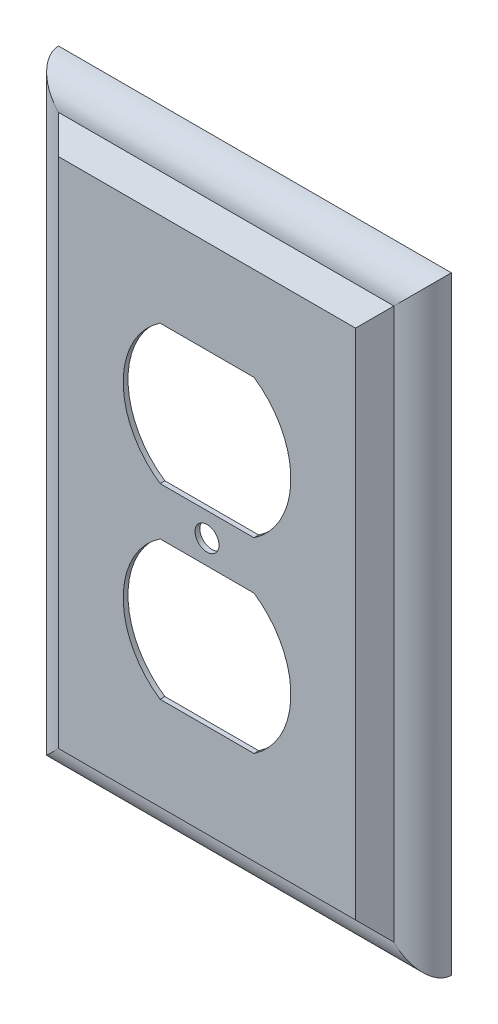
ISO-10303-21;
HEADER;
FILE_DESCRIPTION(('STEP AP214'),'2;1');
FILE_NAME('part.step','',(''),(''),'','','');
FILE_SCHEMA(('AUTOMOTIVE_DESIGN { 1 0 10303 214 1 1 1 1 }'));
ENDSEC;
DATA;
#1=APPLICATION_CONTEXT('core data for automotive mechanical design processes');
#2=APPLICATION_PROTOCOL_DEFINITION('international standard','automotive_design',2000,#1);
#3=PRODUCT_CONTEXT('',#1,'mechanical');
#4=PRODUCT('Part','Part','',(#3));
#5=PRODUCT_RELATED_PRODUCT_CATEGORY('part','',(#4));
#6=PRODUCT_DEFINITION_FORMATION('','',#4);
#7=PRODUCT_DEFINITION_CONTEXT('part definition',#1,'design');
#8=PRODUCT_DEFINITION('design','',#6,#7);
#9=PRODUCT_DEFINITION_SHAPE('','',#8);
#10=(LENGTH_UNIT() NAMED_UNIT(*) SI_UNIT(.MILLI.,.METRE.));
#11=(NAMED_UNIT(*) PLANE_ANGLE_UNIT() SI_UNIT($,.RADIAN.));
#12=(NAMED_UNIT(*) SI_UNIT($,.STERADIAN.) SOLID_ANGLE_UNIT());
#13=UNCERTAINTY_MEASURE_WITH_UNIT(LENGTH_MEASURE(1.E-05),#10,'distance_accuracy_value','');
#14=(GEOMETRIC_REPRESENTATION_CONTEXT(3) GLOBAL_UNCERTAINTY_ASSIGNED_CONTEXT((#13)) GLOBAL_UNIT_ASSIGNED_CONTEXT((#10,
#11,#12)) REPRESENTATION_CONTEXT('',''));
#15=CARTESIAN_POINT('',(0.,0.,0.));
#16=DIRECTION('',(0.,0.,1.));
#17=DIRECTION('',(1.,0.,0.));
#18=AXIS2_PLACEMENT_3D('',#15,#16,#17);
#19=CARTESIAN_POINT('',(0.,115.,0.));
#20=DIRECTION('',(0.,0.,-1.));
#21=DIRECTION('',(-1.,0.,0.));
#22=AXIS2_PLACEMENT_3D('',#19,#20,#21);
#23=PLANE('',#22);
#24=DIRECTION('',(-1.,0.,0.));
#25=VECTOR('',#24,1.);
#26=CARTESIAN_POINT('',(0.,114.,0.));
#27=LINE('',#26,#25);
#28=CARTESIAN_POINT('',(69.,114.,0.));
#29=VERTEX_POINT('',#28);
#30=CARTESIAN_POINT('',(1.,114.,0.));
#31=VERTEX_POINT('',#30);
#32=EDGE_CURVE('E264',#29,#31,#27,.T.);
#33=ORIENTED_EDGE('',*,*,#32,.T.);
#34=DIRECTION('',(0.,-1.,0.));
#35=VECTOR('',#34,1.);
#36=CARTESIAN_POINT('',(1.,115.,0.));
#37=LINE('',#36,#35);
#38=CARTESIAN_POINT('',(1.,1.,0.));
#39=VERTEX_POINT('',#38);
#40=EDGE_CURVE('E278',#31,#39,#37,.T.);
#41=ORIENTED_EDGE('',*,*,#40,.T.);
#42=DIRECTION('',(1.,0.,0.));
#43=VECTOR('',#42,1.);
#44=CARTESIAN_POINT('',(0.,1.,0.));
#45=LINE('',#44,#43);
#46=CARTESIAN_POINT('',(69.,1.,0.));
#47=VERTEX_POINT('',#46);
#48=EDGE_CURVE('E294',#39,#47,#45,.T.);
#49=ORIENTED_EDGE('',*,*,#48,.T.);
#50=DIRECTION('',(0.,1.,0.));
#51=VECTOR('',#50,1.);
#52=CARTESIAN_POINT('',(69.,115.,0.));
#53=LINE('',#52,#51);
#54=EDGE_CURVE('E297',#47,#29,#53,.T.);
#55=ORIENTED_EDGE('',*,*,#54,.T.);
#56=EDGE_LOOP('',(#33,#41,#49,#55));
#57=FACE_BOUND('',#56,.T.);
#58=DIRECTION('',(0.,1.,0.));
#59=VECTOR('',#58,1.);
#60=CARTESIAN_POINT('',(76.,-22.9705627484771,0.));
#61=LINE('',#60,#59);
#62=CARTESIAN_POINT('',(76.,-5.99999999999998,0.));
#63=VERTEX_POINT('',#62);
#64=CARTESIAN_POINT('',(76.,121.,0.));
#65=VERTEX_POINT('',#64);
#66=EDGE_CURVE('E191',#63,#65,#61,.T.);
#67=ORIENTED_EDGE('',*,*,#66,.F.);
#68=DIRECTION('',(-1.,0.,0.));
#69=VECTOR('',#68,1.);
#70=CARTESIAN_POINT('',(76.,-5.99999999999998,0.));
#71=LINE('',#70,#69);
#72=CARTESIAN_POINT('',(-5.99999999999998,-5.99999999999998,0.));
#73=VERTEX_POINT('',#72);
#74=EDGE_CURVE('E175',#63,#73,#71,.T.);
#75=ORIENTED_EDGE('',*,*,#74,.T.);
#76=DIRECTION('',(0.,1.,0.));
#77=VECTOR('',#76,1.);
#78=CARTESIAN_POINT('',(-5.99999999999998,-5.99999999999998,0.));
#79=LINE('',#78,#77);
#80=CARTESIAN_POINT('',(-5.99999999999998,121.,0.));
#81=VERTEX_POINT('',#80);
#82=EDGE_CURVE('E363',#73,#81,#79,.T.);
#83=ORIENTED_EDGE('',*,*,#82,.T.);
#84=DIRECTION('',(1.,0.,0.));
#85=VECTOR('',#84,1.);
#86=CARTESIAN_POINT('',(-5.99999999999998,121.,0.));
#87=LINE('',#86,#85);
#88=EDGE_CURVE('E194',#81,#65,#87,.T.);
#89=ORIENTED_EDGE('',*,*,#88,.T.);
#90=EDGE_LOOP('',(#67,#75,#83,#89));
#91=FACE_BOUND('',#90,.T.);
#92=ADVANCED_FACE('F35',(#57,#91),#23,.T.);
#93=CARTESIAN_POINT('',(0.,115.,10.));
#94=DIRECTION('',(0.,0.,-1.));
#95=DIRECTION('',(-1.,0.,0.));
#96=AXIS2_PLACEMENT_3D('',#93,#94,#95);
#97=PLANE('',#96);
#98=CARTESIAN_POINT('',(35.,57.5,10.));
#99=DIRECTION('',(0.,0.,1.));
#100=DIRECTION('',(1.,0.,0.));
#101=AXIS2_PLACEMENT_3D('',#98,#99,#100);
#102=CIRCLE('',#101,2.5);
#103=CARTESIAN_POINT('',(37.5,57.5,10.));
#104=VERTEX_POINT('',#103);
#105=EDGE_CURVE('E205',#104,#104,#102,.T.);
#106=ORIENTED_EDGE('',*,*,#105,.F.);
#107=EDGE_LOOP('',(#106));
#108=FACE_BOUND('',#107,.T.);
#109=DIRECTION('',(-1.,0.,0.));
#110=VECTOR('',#109,1.);
#111=CARTESIAN_POINT('',(25.2020410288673,62.5,10.));
#112=LINE('',#111,#110);
#113=CARTESIAN_POINT('',(44.7979589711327,62.5,10.));
#114=VERTEX_POINT('',#113);
#115=CARTESIAN_POINT('',(25.2020410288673,62.5,10.));
#116=VERTEX_POINT('',#115);
#117=EDGE_CURVE('E217',#114,#116,#112,.T.);
#118=ORIENTED_EDGE('',*,*,#117,.T.);
#119=CARTESIAN_POINT('',(35.,77.,10.));
#120=DIRECTION('',(0.,0.,-1.));
#121=DIRECTION('',(-1.,0.,0.));
#122=AXIS2_PLACEMENT_3D('',#119,#120,#121);
#123=CIRCLE('',#122,17.5);
#124=CARTESIAN_POINT('',(25.2020410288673,91.5,10.));
#125=VERTEX_POINT('',#124);
#126=EDGE_CURVE('E210',#116,#125,#123,.T.);
#127=ORIENTED_EDGE('',*,*,#126,.T.);
#128=DIRECTION('',(1.,0.,0.));
#129=VECTOR('',#128,1.);
#130=CARTESIAN_POINT('',(25.2020410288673,91.5,10.));
#131=LINE('',#130,#129);
#132=CARTESIAN_POINT('',(44.7979589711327,91.5,10.));
#133=VERTEX_POINT('',#132);
#134=EDGE_CURVE('E213',#125,#133,#131,.T.);
#135=ORIENTED_EDGE('',*,*,#134,.T.);
#136=CARTESIAN_POINT('',(35.,77.,10.));
#137=DIRECTION('',(0.,0.,-1.));
#138=DIRECTION('',(-1.,0.,0.));
#139=AXIS2_PLACEMENT_3D('',#136,#137,#138);
#140=CIRCLE('',#139,17.5);
#141=EDGE_CURVE('E52',#133,#114,#140,.T.);
#142=ORIENTED_EDGE('',*,*,#141,.T.);
#143=EDGE_LOOP('',(#118,#127,#135,#142));
#144=FACE_BOUND('',#143,.T.);
#145=DIRECTION('',(-1.,0.,0.));
#146=VECTOR('',#145,1.);
#147=CARTESIAN_POINT('',(25.2020410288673,23.5,10.));
#148=LINE('',#147,#146);
#149=CARTESIAN_POINT('',(44.7979589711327,23.5,10.));
#150=VERTEX_POINT('',#149);
#151=CARTESIAN_POINT('',(25.2020410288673,23.5,10.));
#152=VERTEX_POINT('',#151);
#153=EDGE_CURVE('E238',#150,#152,#148,.T.);
#154=ORIENTED_EDGE('',*,*,#153,.T.);
#155=CARTESIAN_POINT('',(35.,38.,10.));
#156=DIRECTION('',(0.,0.,-1.));
#157=DIRECTION('',(-1.,0.,0.));
#158=AXIS2_PLACEMENT_3D('',#155,#156,#157);
#159=CIRCLE('',#158,17.5);
#160=CARTESIAN_POINT('',(25.2020410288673,52.5,10.));
#161=VERTEX_POINT('',#160);
#162=EDGE_CURVE('E223',#152,#161,#159,.T.);
#163=ORIENTED_EDGE('',*,*,#162,.T.);
#164=DIRECTION('',(1.,0.,0.));
#165=VECTOR('',#164,1.);
#166=CARTESIAN_POINT('',(25.2020410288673,52.5,10.));
#167=LINE('',#166,#165);
#168=CARTESIAN_POINT('',(44.7979589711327,52.5,10.));
#169=VERTEX_POINT('',#168);
#170=EDGE_CURVE('E232',#161,#169,#167,.T.);
#171=ORIENTED_EDGE('',*,*,#170,.T.);
#172=CARTESIAN_POINT('',(35.,38.,10.));
#173=DIRECTION('',(0.,0.,-1.));
#174=DIRECTION('',(-1.,0.,0.));
#175=AXIS2_PLACEMENT_3D('',#172,#173,#174);
#176=CIRCLE('',#175,17.5);
#177=EDGE_CURVE('E235',#169,#150,#176,.T.);
#178=ORIENTED_EDGE('',*,*,#177,.T.);
#179=EDGE_LOOP('',(#154,#163,#171,#178));
#180=FACE_BOUND('',#179,.T.);
#181=DIRECTION('',(0.,1.,0.));
#182=VECTOR('',#181,1.);
#183=CARTESIAN_POINT('',(65.9999999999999,115.,10.));
#184=LINE('',#183,#182);
#185=CARTESIAN_POINT('',(65.9999999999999,4.00000000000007,10.));
#186=VERTEX_POINT('',#185);
#187=CARTESIAN_POINT('',(65.9999999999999,111.,10.));
#188=VERTEX_POINT('',#187);
#189=EDGE_CURVE('E307',#186,#188,#184,.T.);
#190=ORIENTED_EDGE('',*,*,#189,.T.);
#191=DIRECTION('',(-1.,0.,0.));
#192=VECTOR('',#191,1.);
#193=CARTESIAN_POINT('',(0.,111.,10.));
#194=LINE('',#193,#192);
#195=CARTESIAN_POINT('',(4.00000000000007,111.,10.));
#196=VERTEX_POINT('',#195);
#197=EDGE_CURVE('E309',#188,#196,#194,.T.);
#198=ORIENTED_EDGE('',*,*,#197,.T.);
#199=DIRECTION('',(0.,-1.,0.));
#200=VECTOR('',#199,1.);
#201=CARTESIAN_POINT('',(4.00000000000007,115.,10.));
#202=LINE('',#201,#200);
#203=CARTESIAN_POINT('',(4.00000000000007,4.00000000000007,10.));
#204=VERTEX_POINT('',#203);
#205=EDGE_CURVE('E302',#196,#204,#202,.T.);
#206=ORIENTED_EDGE('',*,*,#205,.T.);
#207=DIRECTION('',(1.,0.,0.));
#208=VECTOR('',#207,1.);
#209=CARTESIAN_POINT('',(0.,4.00000000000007,10.));
#210=LINE('',#209,#208);
#211=EDGE_CURVE('E304',#204,#186,#210,.T.);
#212=ORIENTED_EDGE('',*,*,#211,.T.);
#213=EDGE_LOOP('',(#190,#198,#206,#212));
#214=FACE_BOUND('',#213,.T.);
#215=ADVANCED_FACE('F372',(#108,#144,#180,#214),#97,.F.);
#216=CARTESIAN_POINT('',(0.,4.00000000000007,10.));
#217=DIRECTION('',(0.,0.707106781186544,-0.707106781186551));
#218=DIRECTION('',(0.,0.707106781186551,0.707106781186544));
#219=AXIS2_PLACEMENT_3D('',#216,#217,#218);
#220=PLANE('',#219);
#221=DIRECTION('',(0.577350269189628,0.577350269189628,0.577350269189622));
#222=VECTOR('',#221,1.);
#223=CARTESIAN_POINT('',(41.0000000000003,41.0000000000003,46.9999999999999));
#224=LINE('',#223,#222);
#225=CARTESIAN_POINT('',(0.,0.,5.99999999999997));
#226=VERTEX_POINT('',#225);
#227=EDGE_CURVE('E321',#226,#204,#224,.T.);
#228=ORIENTED_EDGE('',*,*,#227,.F.);
#229=DIRECTION('',(-1.,0.,0.));
#230=VECTOR('',#229,1.);
#231=CARTESIAN_POINT('',(0.,0.,5.99999999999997));
#232=LINE('',#231,#230);
#233=CARTESIAN_POINT('',(70.,0.,5.99999999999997));
#234=VERTEX_POINT('',#233);
#235=EDGE_CURVE('E313',#234,#226,#232,.T.);
#236=ORIENTED_EDGE('',*,*,#235,.F.);
#237=DIRECTION('',(-0.577350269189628,0.577350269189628,0.577350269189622));
#238=VECTOR('',#237,1.);
#239=CARTESIAN_POINT('',(43.9999999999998,26.0000000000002,31.9999999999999));
#240=LINE('',#239,#238);
#241=EDGE_CURVE('E305',#186,#234,#240,.F.);
#242=ORIENTED_EDGE('',*,*,#241,.F.);
#243=ORIENTED_EDGE('',*,*,#211,.F.);
#244=EDGE_LOOP('',(#228,#236,#242,#243));
#245=FACE_BOUND('',#244,.T.);
#246=ADVANCED_FACE('F37',(#245),#220,.F.);
#247=CARTESIAN_POINT('',(65.9999999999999,115.,10.));
#248=DIRECTION('',(-0.707106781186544,0.,-0.707106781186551));
#249=DIRECTION('',(-0.707106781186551,0.,0.707106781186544));
#250=AXIS2_PLACEMENT_3D('',#247,#248,#249);
#251=PLANE('',#250);
#252=ORIENTED_EDGE('',*,*,#241,.T.);
#253=DIRECTION('',(0.,-1.,0.));
#254=VECTOR('',#253,1.);
#255=CARTESIAN_POINT('',(70.,0.,5.99999999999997));
#256=LINE('',#255,#254);
#257=CARTESIAN_POINT('',(70.,115.,5.99999999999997));
#258=VERTEX_POINT('',#257);
#259=EDGE_CURVE('E192',#258,#234,#256,.T.);
#260=ORIENTED_EDGE('',*,*,#259,.F.);
#261=DIRECTION('',(-0.577350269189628,-0.577350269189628,0.577350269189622));
#262=VECTOR('',#261,1.);
#263=CARTESIAN_POINT('',(67.3333333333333,112.333333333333,8.66666666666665));
#264=LINE('',#263,#262);
#265=EDGE_CURVE('E320',#188,#258,#264,.F.);
#266=ORIENTED_EDGE('',*,*,#265,.F.);
#267=ORIENTED_EDGE('',*,*,#189,.F.);
#268=EDGE_LOOP('',(#252,#260,#266,#267));
#269=FACE_BOUND('',#268,.T.);
#270=ADVANCED_FACE('F374',(#269),#251,.F.);
#271=CARTESIAN_POINT('',(4.00000000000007,115.,10.));
#272=DIRECTION('',(0.707106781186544,0.,-0.707106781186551));
#273=DIRECTION('',(-0.707106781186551,0.,-0.707106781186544));
#274=AXIS2_PLACEMENT_3D('',#271,#272,#273);
#275=PLANE('',#274);
#276=ORIENTED_EDGE('',*,*,#227,.T.);
#277=ORIENTED_EDGE('',*,*,#205,.F.);
#278=DIRECTION('',(-0.577350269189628,0.577350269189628,-0.577350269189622));
#279=VECTOR('',#278,1.);
#280=CARTESIAN_POINT('',(2.6666666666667,112.333333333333,8.66666666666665));
#281=LINE('',#280,#279);
#282=CARTESIAN_POINT('',(0.,115.,5.99999999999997));
#283=VERTEX_POINT('',#282);
#284=EDGE_CURVE('E259',#283,#196,#281,.F.);
#285=ORIENTED_EDGE('',*,*,#284,.F.);
#286=DIRECTION('',(0.,1.,0.));
#287=VECTOR('',#286,1.);
#288=CARTESIAN_POINT('',(0.,0.,5.99999999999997));
#289=LINE('',#288,#287);
#290=EDGE_CURVE('E315',#226,#283,#289,.T.);
#291=ORIENTED_EDGE('',*,*,#290,.F.);
#292=EDGE_LOOP('',(#276,#277,#285,#291));
#293=FACE_BOUND('',#292,.T.);
#294=ADVANCED_FACE('F368',(#293),#275,.F.);
#295=CARTESIAN_POINT('',(0.,111.,10.));
#296=DIRECTION('',(0.,-0.707106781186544,-0.707106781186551));
#297=DIRECTION('',(0.,0.707106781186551,-0.707106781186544));
#298=AXIS2_PLACEMENT_3D('',#295,#296,#297);
#299=PLANE('',#298);
#300=ORIENTED_EDGE('',*,*,#265,.T.);
#301=DIRECTION('',(1.,0.,0.));
#302=VECTOR('',#301,1.);
#303=CARTESIAN_POINT('',(0.,115.,5.99999999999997));
#304=LINE('',#303,#302);
#305=EDGE_CURVE('E312',#283,#258,#304,.T.);
#306=ORIENTED_EDGE('',*,*,#305,.F.);
#307=ORIENTED_EDGE('',*,*,#284,.T.);
#308=ORIENTED_EDGE('',*,*,#197,.F.);
#309=EDGE_LOOP('',(#300,#306,#307,#308));
#310=FACE_BOUND('',#309,.T.);
#311=ADVANCED_FACE('F351',(#310),#299,.F.);
#312=CARTESIAN_POINT('',(1.,0.,10.));
#313=DIRECTION('',(1.,0.,0.));
#314=DIRECTION('',(0.,0.,-1.));
#315=AXIS2_PLACEMENT_3D('',#312,#313,#314);
#316=PLANE('',#315);
#317=DIRECTION('',(0.,0.,-1.));
#318=VECTOR('',#317,1.);
#319=CARTESIAN_POINT('',(1.,1.,10.));
#320=LINE('',#319,#318);
#321=CARTESIAN_POINT('',(0.999999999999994,1.,5.58578643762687));
#322=VERTEX_POINT('',#321);
#323=EDGE_CURVE('E253',#322,#39,#320,.T.);
#324=ORIENTED_EDGE('',*,*,#323,.T.);
#325=ORIENTED_EDGE('',*,*,#40,.F.);
#326=DIRECTION('',(0.,0.,-1.));
#327=VECTOR('',#326,1.);
#328=CARTESIAN_POINT('',(1.,114.,10.));
#329=LINE('',#328,#327);
#330=CARTESIAN_POINT('',(1.,114.,5.58578643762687));
#331=VERTEX_POINT('',#330);
#332=EDGE_CURVE('E261',#331,#31,#329,.T.);
#333=ORIENTED_EDGE('',*,*,#332,.F.);
#334=DIRECTION('',(0.,-1.,0.));
#335=VECTOR('',#334,1.);
#336=CARTESIAN_POINT('',(1.,115.,5.58578643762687));
#337=LINE('',#336,#335);
#338=EDGE_CURVE('E257',#322,#331,#337,.F.);
#339=ORIENTED_EDGE('',*,*,#338,.F.);
#340=EDGE_LOOP('',(#324,#325,#333,#339));
#341=FACE_BOUND('',#340,.T.);
#342=ADVANCED_FACE('F392',(#341),#316,.T.);
#343=CARTESIAN_POINT('',(0.,1.,10.));
#344=DIRECTION('',(0.,1.,0.));
#345=DIRECTION('',(0.,0.,1.));
#346=AXIS2_PLACEMENT_3D('',#343,#344,#345);
#347=PLANE('',#346);
#348=DIRECTION('',(0.,0.,-1.));
#349=VECTOR('',#348,1.);
#350=CARTESIAN_POINT('',(69.,1.,10.));
#351=LINE('',#350,#349);
#352=CARTESIAN_POINT('',(69.,0.999999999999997,5.58578643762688));
#353=VERTEX_POINT('',#352);
#354=EDGE_CURVE('E256',#353,#47,#351,.T.);
#355=ORIENTED_EDGE('',*,*,#354,.T.);
#356=ORIENTED_EDGE('',*,*,#48,.F.);
#357=ORIENTED_EDGE('',*,*,#323,.F.);
#358=DIRECTION('',(1.,0.,0.));
#359=VECTOR('',#358,1.);
#360=CARTESIAN_POINT('',(0.,1.,5.58578643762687));
#361=LINE('',#360,#359);
#362=EDGE_CURVE('E260',#353,#322,#361,.F.);
#363=ORIENTED_EDGE('',*,*,#362,.F.);
#364=EDGE_LOOP('',(#355,#356,#357,#363));
#365=FACE_BOUND('',#364,.T.);
#366=ADVANCED_FACE('F409',(#365),#347,.T.);
#367=CARTESIAN_POINT('',(69.,0.,10.));
#368=DIRECTION('',(-1.,0.,0.));
#369=DIRECTION('',(0.,0.,1.));
#370=AXIS2_PLACEMENT_3D('',#367,#368,#369);
#371=PLANE('',#370);
#372=DIRECTION('',(0.,0.,-1.));
#373=VECTOR('',#372,1.);
#374=CARTESIAN_POINT('',(69.,114.,10.));
#375=LINE('',#374,#373);
#376=CARTESIAN_POINT('',(69.,114.,5.58578643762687));
#377=VERTEX_POINT('',#376);
#378=EDGE_CURVE('E263',#377,#29,#375,.T.);
#379=ORIENTED_EDGE('',*,*,#378,.T.);
#380=ORIENTED_EDGE('',*,*,#54,.F.);
#381=ORIENTED_EDGE('',*,*,#354,.F.);
#382=DIRECTION('',(0.,1.,0.));
#383=VECTOR('',#382,1.);
#384=CARTESIAN_POINT('',(69.,115.,5.58578643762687));
#385=LINE('',#384,#383);
#386=EDGE_CURVE('E268',#377,#353,#385,.F.);
#387=ORIENTED_EDGE('',*,*,#386,.F.);
#388=EDGE_LOOP('',(#379,#380,#381,#387));
#389=FACE_BOUND('',#388,.T.);
#390=ADVANCED_FACE('F417',(#389),#371,.T.);
#391=CARTESIAN_POINT('',(0.,114.,10.));
#392=DIRECTION('',(0.,-1.,0.));
#393=DIRECTION('',(0.,0.,-1.));
#394=AXIS2_PLACEMENT_3D('',#391,#392,#393);
#395=PLANE('',#394);
#396=ORIENTED_EDGE('',*,*,#332,.T.);
#397=ORIENTED_EDGE('',*,*,#32,.F.);
#398=ORIENTED_EDGE('',*,*,#378,.F.);
#399=DIRECTION('',(-1.,0.,0.));
#400=VECTOR('',#399,1.);
#401=CARTESIAN_POINT('',(0.,114.,5.58578643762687));
#402=LINE('',#401,#400);
#403=EDGE_CURVE('E271',#331,#377,#402,.F.);
#404=ORIENTED_EDGE('',*,*,#403,.F.);
#405=EDGE_LOOP('',(#396,#397,#398,#404));
#406=FACE_BOUND('',#405,.T.);
#407=ADVANCED_FACE('F425',(#406),#395,.T.);
#408=CARTESIAN_POINT('',(0.,115.,9.));
#409=DIRECTION('',(0.,0.,-1.));
#410=DIRECTION('',(-1.,0.,0.));
#411=AXIS2_PLACEMENT_3D('',#408,#409,#410);
#412=PLANE('',#411);
#413=CARTESIAN_POINT('',(35.,57.5,9.));
#414=DIRECTION('',(0.,0.,-1.));
#415=DIRECTION('',(-1.,0.,0.));
#416=AXIS2_PLACEMENT_3D('',#413,#414,#415);
#417=CIRCLE('',#416,2.5);
#418=CARTESIAN_POINT('',(32.5,57.5,9.));
#419=VERTEX_POINT('',#418);
#420=EDGE_CURVE('E208',#419,#419,#417,.T.);
#421=ORIENTED_EDGE('',*,*,#420,.F.);
#422=EDGE_LOOP('',(#421));
#423=FACE_BOUND('',#422,.T.);
#424=CARTESIAN_POINT('',(35.,77.,9.));
#425=DIRECTION('',(0.,0.,-1.));
#426=DIRECTION('',(-1.,0.,0.));
#427=AXIS2_PLACEMENT_3D('',#424,#425,#426);
#428=CIRCLE('',#427,17.5);
#429=CARTESIAN_POINT('',(25.2020410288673,62.5,9.));
#430=VERTEX_POINT('',#429);
#431=CARTESIAN_POINT('',(25.2020410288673,91.5,9.));
#432=VERTEX_POINT('',#431);
#433=EDGE_CURVE('E12',#430,#432,#428,.T.);
#434=ORIENTED_EDGE('',*,*,#433,.F.);
#435=DIRECTION('',(-1.,0.,0.));
#436=VECTOR('',#435,1.);
#437=CARTESIAN_POINT('',(0.,62.5,9.));
#438=LINE('',#437,#436);
#439=CARTESIAN_POINT('',(44.7979589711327,62.5,9.));
#440=VERTEX_POINT('',#439);
#441=EDGE_CURVE('E44',#440,#430,#438,.T.);
#442=ORIENTED_EDGE('',*,*,#441,.F.);
#443=CARTESIAN_POINT('',(35.,77.,9.));
#444=DIRECTION('',(0.,0.,-1.));
#445=DIRECTION('',(-1.,0.,0.));
#446=AXIS2_PLACEMENT_3D('',#443,#444,#445);
#447=CIRCLE('',#446,17.5);
#448=CARTESIAN_POINT('',(44.7979589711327,91.5,9.));
#449=VERTEX_POINT('',#448);
#450=EDGE_CURVE('E336',#449,#440,#447,.T.);
#451=ORIENTED_EDGE('',*,*,#450,.F.);
#452=DIRECTION('',(1.,0.,0.));
#453=VECTOR('',#452,1.);
#454=CARTESIAN_POINT('',(0.,91.5,9.));
#455=LINE('',#454,#453);
#456=EDGE_CURVE('E334',#432,#449,#455,.T.);
#457=ORIENTED_EDGE('',*,*,#456,.F.);
#458=EDGE_LOOP('',(#434,#442,#451,#457));
#459=FACE_BOUND('',#458,.T.);
#460=CARTESIAN_POINT('',(35.,38.,9.));
#461=DIRECTION('',(0.,0.,-1.));
#462=DIRECTION('',(-1.,0.,0.));
#463=AXIS2_PLACEMENT_3D('',#460,#461,#462);
#464=CIRCLE('',#463,17.5);
#465=CARTESIAN_POINT('',(25.2020410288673,23.5,9.));
#466=VERTEX_POINT('',#465);
#467=CARTESIAN_POINT('',(25.2020410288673,52.5,9.));
#468=VERTEX_POINT('',#467);
#469=EDGE_CURVE('E331',#466,#468,#464,.T.);
#470=ORIENTED_EDGE('',*,*,#469,.F.);
#471=DIRECTION('',(-1.,0.,0.));
#472=VECTOR('',#471,1.);
#473=CARTESIAN_POINT('',(0.,23.5,9.));
#474=LINE('',#473,#472);
#475=CARTESIAN_POINT('',(44.7979589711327,23.5,9.));
#476=VERTEX_POINT('',#475);
#477=EDGE_CURVE('E329',#476,#466,#474,.T.);
#478=ORIENTED_EDGE('',*,*,#477,.F.);
#479=CARTESIAN_POINT('',(35.,38.,9.));
#480=DIRECTION('',(0.,0.,-1.));
#481=DIRECTION('',(-1.,0.,0.));
#482=AXIS2_PLACEMENT_3D('',#479,#480,#481);
#483=CIRCLE('',#482,17.5);
#484=CARTESIAN_POINT('',(44.7979589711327,52.5,9.));
#485=VERTEX_POINT('',#484);
#486=EDGE_CURVE('E327',#485,#476,#483,.T.);
#487=ORIENTED_EDGE('',*,*,#486,.F.);
#488=DIRECTION('',(1.,0.,0.));
#489=VECTOR('',#488,1.);
#490=CARTESIAN_POINT('',(0.,52.5,9.));
#491=LINE('',#490,#489);
#492=EDGE_CURVE('E318',#468,#485,#491,.T.);
#493=ORIENTED_EDGE('',*,*,#492,.F.);
#494=EDGE_LOOP('',(#470,#478,#487,#493));
#495=FACE_BOUND('',#494,.T.);
#496=DIRECTION('',(0.,-1.,0.));
#497=VECTOR('',#496,1.);
#498=CARTESIAN_POINT('',(65.5857864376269,115.,9.));
#499=LINE('',#498,#497);
#500=CARTESIAN_POINT('',(65.5857864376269,4.41421356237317,9.));
#501=VERTEX_POINT('',#500);
#502=CARTESIAN_POINT('',(65.5857864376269,110.585786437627,9.));
#503=VERTEX_POINT('',#502);
#504=EDGE_CURVE('E282',#501,#503,#499,.F.);
#505=ORIENTED_EDGE('',*,*,#504,.F.);
#506=DIRECTION('',(-1.,0.,0.));
#507=VECTOR('',#506,1.);
#508=CARTESIAN_POINT('',(0.,4.41421356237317,9.));
#509=LINE('',#508,#507);
#510=CARTESIAN_POINT('',(4.41421356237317,4.41421356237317,9.));
#511=VERTEX_POINT('',#510);
#512=EDGE_CURVE('E284',#511,#501,#509,.F.);
#513=ORIENTED_EDGE('',*,*,#512,.F.);
#514=DIRECTION('',(0.,1.,0.));
#515=VECTOR('',#514,1.);
#516=CARTESIAN_POINT('',(4.41421356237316,115.,9.));
#517=LINE('',#516,#515);
#518=CARTESIAN_POINT('',(4.41421356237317,110.585786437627,9.));
#519=VERTEX_POINT('',#518);
#520=EDGE_CURVE('E255',#519,#511,#517,.F.);
#521=ORIENTED_EDGE('',*,*,#520,.F.);
#522=DIRECTION('',(1.,0.,0.));
#523=VECTOR('',#522,1.);
#524=CARTESIAN_POINT('',(0.,110.585786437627,9.));
#525=LINE('',#524,#523);
#526=EDGE_CURVE('E274',#503,#519,#525,.F.);
#527=ORIENTED_EDGE('',*,*,#526,.F.);
#528=EDGE_LOOP('',(#505,#513,#521,#527));
#529=FACE_BOUND('',#528,.T.);
#530=ADVANCED_FACE('F433',(#423,#459,#495,#529),#412,.T.);
#531=CARTESIAN_POINT('',(0.,4.70710678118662,9.29289321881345));
#532=DIRECTION('',(0.,0.707106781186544,-0.707106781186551));
#533=DIRECTION('',(0.,0.707106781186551,0.707106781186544));
#534=AXIS2_PLACEMENT_3D('',#531,#532,#533);
#535=PLANE('',#534);
#536=DIRECTION('',(0.577350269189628,0.577350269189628,0.577350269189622));
#537=VECTOR('',#536,1.);
#538=CARTESIAN_POINT('',(41.4714045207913,41.4714045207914,46.0571909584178));
#539=LINE('',#538,#537);
#540=EDGE_CURVE('E279',#322,#511,#539,.T.);
#541=ORIENTED_EDGE('',*,*,#540,.T.);
#542=ORIENTED_EDGE('',*,*,#512,.T.);
#543=DIRECTION('',(0.577350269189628,-0.577350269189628,-0.577350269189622));
#544=VECTOR('',#543,1.);
#545=CARTESIAN_POINT('',(28.5285954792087,41.4714045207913,46.0571909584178));
#546=LINE('',#545,#544);
#547=EDGE_CURVE('E275',#501,#353,#546,.T.);
#548=ORIENTED_EDGE('',*,*,#547,.T.);
#549=ORIENTED_EDGE('',*,*,#362,.T.);
#550=EDGE_LOOP('',(#541,#542,#548,#549));
#551=FACE_BOUND('',#550,.T.);
#552=ADVANCED_FACE('F442',(#551),#535,.T.);
#553=CARTESIAN_POINT('',(65.2928932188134,115.,9.29289321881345));
#554=DIRECTION('',(-0.707106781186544,0.,-0.707106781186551));
#555=DIRECTION('',(-0.707106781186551,0.,0.707106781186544));
#556=AXIS2_PLACEMENT_3D('',#553,#554,#555);
#557=PLANE('',#556);
#558=ORIENTED_EDGE('',*,*,#547,.F.);
#559=ORIENTED_EDGE('',*,*,#504,.T.);
#560=DIRECTION('',(0.577350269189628,0.577350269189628,-0.577350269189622));
#561=VECTOR('',#560,1.);
#562=CARTESIAN_POINT('',(43.5285954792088,88.5285954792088,31.0571909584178));
#563=LINE('',#562,#561);
#564=EDGE_CURVE('E280',#503,#377,#563,.T.);
#565=ORIENTED_EDGE('',*,*,#564,.T.);
#566=ORIENTED_EDGE('',*,*,#386,.T.);
#567=EDGE_LOOP('',(#558,#559,#565,#566));
#568=FACE_BOUND('',#567,.T.);
#569=ADVANCED_FACE('F451',(#568),#557,.T.);
#570=CARTESIAN_POINT('',(4.70710678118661,115.,9.29289321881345));
#571=DIRECTION('',(0.707106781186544,0.,-0.707106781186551));
#572=DIRECTION('',(-0.707106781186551,0.,-0.707106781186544));
#573=AXIS2_PLACEMENT_3D('',#570,#571,#572);
#574=PLANE('',#573);
#575=ORIENTED_EDGE('',*,*,#540,.F.);
#576=ORIENTED_EDGE('',*,*,#338,.T.);
#577=DIRECTION('',(0.577350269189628,-0.577350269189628,0.577350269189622));
#578=VECTOR('',#577,1.);
#579=CARTESIAN_POINT('',(3.13807118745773,111.861928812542,7.72385762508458));
#580=LINE('',#579,#578);
#581=EDGE_CURVE('E245',#331,#519,#580,.T.);
#582=ORIENTED_EDGE('',*,*,#581,.T.);
#583=ORIENTED_EDGE('',*,*,#520,.T.);
#584=EDGE_LOOP('',(#575,#576,#582,#583));
#585=FACE_BOUND('',#584,.T.);
#586=ADVANCED_FACE('F459',(#585),#574,.T.);
#587=CARTESIAN_POINT('',(0.,110.292893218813,9.29289321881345));
#588=DIRECTION('',(0.,-0.707106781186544,-0.707106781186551));
#589=DIRECTION('',(0.,0.707106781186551,-0.707106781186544));
#590=AXIS2_PLACEMENT_3D('',#587,#588,#589);
#591=PLANE('',#590);
#592=ORIENTED_EDGE('',*,*,#564,.F.);
#593=ORIENTED_EDGE('',*,*,#526,.T.);
#594=ORIENTED_EDGE('',*,*,#581,.F.);
#595=ORIENTED_EDGE('',*,*,#403,.T.);
#596=EDGE_LOOP('',(#592,#593,#594,#595));
#597=FACE_BOUND('',#596,.T.);
#598=ADVANCED_FACE('F467',(#597),#591,.T.);
#599=CARTESIAN_POINT('',(35.,38.,10.));
#600=DIRECTION('',(0.,0.,-1.));
#601=DIRECTION('',(-1.,0.,0.));
#602=AXIS2_PLACEMENT_3D('',#599,#600,#601);
#603=CYLINDRICAL_SURFACE('',#602,17.5);
#604=ORIENTED_EDGE('',*,*,#469,.T.);
#605=DIRECTION('',(0.,0.,-1.));
#606=VECTOR('',#605,1.);
#607=CARTESIAN_POINT('',(25.2020410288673,52.5,10.));
#608=LINE('',#607,#606);
#609=EDGE_CURVE('E241',#161,#468,#608,.T.);
#610=ORIENTED_EDGE('',*,*,#609,.F.);
#611=ORIENTED_EDGE('',*,*,#162,.F.);
#612=DIRECTION('',(0.,0.,-1.));
#613=VECTOR('',#612,1.);
#614=CARTESIAN_POINT('',(25.2020410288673,23.5,10.));
#615=LINE('',#614,#613);
#616=EDGE_CURVE('E242',#152,#466,#615,.T.);
#617=ORIENTED_EDGE('',*,*,#616,.T.);
#618=EDGE_LOOP('',(#604,#610,#611,#617));
#619=FACE_BOUND('',#618,.T.);
#620=ADVANCED_FACE('F475',(#619),#603,.F.);
#621=CARTESIAN_POINT('',(25.2020410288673,23.5,10.));
#622=DIRECTION('',(0.,-1.,0.));
#623=DIRECTION('',(0.,0.,-1.));
#624=AXIS2_PLACEMENT_3D('',#621,#622,#623);
#625=PLANE('',#624);
#626=ORIENTED_EDGE('',*,*,#477,.T.);
#627=ORIENTED_EDGE('',*,*,#616,.F.);
#628=ORIENTED_EDGE('',*,*,#153,.F.);
#629=DIRECTION('',(0.,0.,-1.));
#630=VECTOR('',#629,1.);
#631=CARTESIAN_POINT('',(44.7979589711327,23.5,10.));
#632=LINE('',#631,#630);
#633=EDGE_CURVE('E246',#150,#476,#632,.T.);
#634=ORIENTED_EDGE('',*,*,#633,.T.);
#635=EDGE_LOOP('',(#626,#627,#628,#634));
#636=FACE_BOUND('',#635,.T.);
#637=ADVANCED_FACE('F482',(#636),#625,.F.);
#638=CARTESIAN_POINT('',(35.,38.,10.));
#639=DIRECTION('',(0.,0.,-1.));
#640=DIRECTION('',(-1.,0.,0.));
#641=AXIS2_PLACEMENT_3D('',#638,#639,#640);
#642=CYLINDRICAL_SURFACE('',#641,17.5);
#643=ORIENTED_EDGE('',*,*,#486,.T.);
#644=ORIENTED_EDGE('',*,*,#633,.F.);
#645=ORIENTED_EDGE('',*,*,#177,.F.);
#646=DIRECTION('',(0.,0.,-1.));
#647=VECTOR('',#646,1.);
#648=CARTESIAN_POINT('',(44.7979589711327,52.5,10.));
#649=LINE('',#648,#647);
#650=EDGE_CURVE('E249',#169,#485,#649,.T.);
#651=ORIENTED_EDGE('',*,*,#650,.T.);
#652=EDGE_LOOP('',(#643,#644,#645,#651));
#653=FACE_BOUND('',#652,.T.);
#654=ADVANCED_FACE('F490',(#653),#642,.F.);
#655=CARTESIAN_POINT('',(25.2020410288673,52.5,10.));
#656=DIRECTION('',(0.,1.,0.));
#657=DIRECTION('',(0.,0.,1.));
#658=AXIS2_PLACEMENT_3D('',#655,#656,#657);
#659=PLANE('',#658);
#660=ORIENTED_EDGE('',*,*,#492,.T.);
#661=ORIENTED_EDGE('',*,*,#650,.F.);
#662=ORIENTED_EDGE('',*,*,#170,.F.);
#663=ORIENTED_EDGE('',*,*,#609,.T.);
#664=EDGE_LOOP('',(#660,#661,#662,#663));
#665=FACE_BOUND('',#664,.T.);
#666=ADVANCED_FACE('F498',(#665),#659,.F.);
#667=CARTESIAN_POINT('',(35.,77.,10.));
#668=DIRECTION('',(0.,0.,-1.));
#669=DIRECTION('',(-1.,0.,0.));
#670=AXIS2_PLACEMENT_3D('',#667,#668,#669);
#671=CYLINDRICAL_SURFACE('',#670,17.5);
#672=ORIENTED_EDGE('',*,*,#433,.T.);
#673=DIRECTION('',(0.,0.,-1.));
#674=VECTOR('',#673,1.);
#675=CARTESIAN_POINT('',(25.2020410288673,91.5,10.));
#676=LINE('',#675,#674);
#677=EDGE_CURVE('E60',#125,#432,#676,.T.);
#678=ORIENTED_EDGE('',*,*,#677,.F.);
#679=ORIENTED_EDGE('',*,*,#126,.F.);
#680=DIRECTION('',(0.,0.,-1.));
#681=VECTOR('',#680,1.);
#682=CARTESIAN_POINT('',(25.2020410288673,62.5,10.));
#683=LINE('',#682,#681);
#684=EDGE_CURVE('E220',#116,#430,#683,.T.);
#685=ORIENTED_EDGE('',*,*,#684,.T.);
#686=EDGE_LOOP('',(#672,#678,#679,#685));
#687=FACE_BOUND('',#686,.T.);
#688=ADVANCED_FACE('F506',(#687),#671,.F.);
#689=CARTESIAN_POINT('',(25.2020410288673,62.5,10.));
#690=DIRECTION('',(0.,-1.,0.));
#691=DIRECTION('',(0.,0.,-1.));
#692=AXIS2_PLACEMENT_3D('',#689,#690,#691);
#693=PLANE('',#692);
#694=ORIENTED_EDGE('',*,*,#441,.T.);
#695=ORIENTED_EDGE('',*,*,#684,.F.);
#696=ORIENTED_EDGE('',*,*,#117,.F.);
#697=DIRECTION('',(0.,0.,-1.));
#698=VECTOR('',#697,1.);
#699=CARTESIAN_POINT('',(44.7979589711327,62.5,10.));
#700=LINE('',#699,#698);
#701=EDGE_CURVE('E224',#114,#440,#700,.T.);
#702=ORIENTED_EDGE('',*,*,#701,.T.);
#703=EDGE_LOOP('',(#694,#695,#696,#702));
#704=FACE_BOUND('',#703,.T.);
#705=ADVANCED_FACE('F514',(#704),#693,.F.);
#706=CARTESIAN_POINT('',(35.,77.,10.));
#707=DIRECTION('',(0.,0.,-1.));
#708=DIRECTION('',(-1.,0.,0.));
#709=AXIS2_PLACEMENT_3D('',#706,#707,#708);
#710=CYLINDRICAL_SURFACE('',#709,17.5);
#711=ORIENTED_EDGE('',*,*,#450,.T.);
#712=ORIENTED_EDGE('',*,*,#701,.F.);
#713=ORIENTED_EDGE('',*,*,#141,.F.);
#714=DIRECTION('',(0.,0.,-1.));
#715=VECTOR('',#714,1.);
#716=CARTESIAN_POINT('',(44.7979589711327,91.5,10.));
#717=LINE('',#716,#715);
#718=EDGE_CURVE('E227',#133,#449,#717,.T.);
#719=ORIENTED_EDGE('',*,*,#718,.T.);
#720=EDGE_LOOP('',(#711,#712,#713,#719));
#721=FACE_BOUND('',#720,.T.);
#722=ADVANCED_FACE('F522',(#721),#710,.F.);
#723=CARTESIAN_POINT('',(25.2020410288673,91.5,10.));
#724=DIRECTION('',(0.,1.,0.));
#725=DIRECTION('',(0.,0.,1.));
#726=AXIS2_PLACEMENT_3D('',#723,#724,#725);
#727=PLANE('',#726);
#728=ORIENTED_EDGE('',*,*,#456,.T.);
#729=ORIENTED_EDGE('',*,*,#718,.F.);
#730=ORIENTED_EDGE('',*,*,#134,.F.);
#731=ORIENTED_EDGE('',*,*,#677,.T.);
#732=EDGE_LOOP('',(#728,#729,#730,#731));
#733=FACE_BOUND('',#732,.T.);
#734=ADVANCED_FACE('F530',(#733),#727,.F.);
#735=CARTESIAN_POINT('',(35.,57.5,0.));
#736=DIRECTION('',(0.,0.,1.));
#737=DIRECTION('',(1.,0.,0.));
#738=AXIS2_PLACEMENT_3D('',#735,#736,#737);
#739=CYLINDRICAL_SURFACE('',#738,2.5);
#740=ORIENTED_EDGE('',*,*,#420,.T.);
#741=EDGE_LOOP('',(#740));
#742=FACE_BOUND('',#741,.T.);
#743=ORIENTED_EDGE('',*,*,#105,.T.);
#744=EDGE_LOOP('',(#743));
#745=FACE_BOUND('',#744,.T.);
#746=ADVANCED_FACE('F537',(#742,#745),#739,.F.);
#747=CARTESIAN_POINT('',(0.,115.,0.));
#748=DIRECTION('',(1.,0.,0.));
#749=DIRECTION('',(0.,0.,-1.));
#750=AXIS2_PLACEMENT_3D('',#747,#748,#749);
#751=CYLINDRICAL_SURFACE('',#750,5.99999999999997);
#752=ORIENTED_EDGE('',*,*,#305,.T.);
#753=CARTESIAN_POINT('',(70.,115.,5.99999999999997));
#754=CARTESIAN_POINT('',(70.0517006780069,115.051707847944,5.99999983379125));
#755=CARTESIAN_POINT('',(70.1034049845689,115.103412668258,5.99933159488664));
#756=CARTESIAN_POINT('',(70.1938723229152,115.193877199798,5.99699224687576));
#757=CARTESIAN_POINT('',(70.2326387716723,115.232641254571,5.9956136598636));
#758=CARTESIAN_POINT('',(70.2790663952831,115.279066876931,5.99351154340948));
#759=CARTESIAN_POINT('',(70.286736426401,115.286736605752,5.99314951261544));
#760=CARTESIAN_POINT('',(70.329494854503,115.329494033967,5.99104897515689));
#761=CARTESIAN_POINT('',(70.3645750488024,115.364575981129,5.98901659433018));
#762=CARTESIAN_POINT('',(70.4426290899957,115.44263161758,5.98380591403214));
#763=CARTESIAN_POINT('',(70.4855980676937,115.485599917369,5.98047252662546));
#764=CARTESIAN_POINT('',(70.548403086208,115.548403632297,5.97491847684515));
#765=CARTESIAN_POINT('',(70.5682555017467,115.56825559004,5.97306314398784));
#766=CARTESIAN_POINT('',(70.6109238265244,115.610923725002,5.96886069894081));
#767=CARTESIAN_POINT('',(70.6337381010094,115.633738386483,5.9664815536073));
#768=CARTESIAN_POINT('',(70.7002064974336,115.700207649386,5.95916426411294));
#769=CARTESIAN_POINT('',(70.7438417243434,115.743843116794,5.95387537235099));
#770=CARTESIAN_POINT('',(70.818441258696,115.81844193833,5.94399952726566));
#771=CARTESIAN_POINT('',(70.8494213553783,115.849421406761,5.93965175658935));
#772=CARTESIAN_POINT('',(70.8916206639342,115.891620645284,5.93339208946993));
#773=CARTESIAN_POINT('',(70.902856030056,115.902856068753,5.93169285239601));
#774=CARTESIAN_POINT('',(70.957847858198,115.957848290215,5.9232159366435));
#775=CARTESIAN_POINT('',(71.0015694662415,116.001570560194,5.91598037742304));
#776=CARTESIAN_POINT('',(71.0870541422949,116.087054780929,5.90085709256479));
#777=CARTESIAN_POINT('',(71.1288208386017,116.128820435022,5.89301060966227));
#778=CARTESIAN_POINT('',(71.2154542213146,116.215454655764,5.8757779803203));
#779=CARTESIAN_POINT('',(71.2603136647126,116.260316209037,5.86631997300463));
#780=CARTESIAN_POINT('',(71.3485724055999,116.348579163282,5.84665005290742));
#781=CARTESIAN_POINT('',(71.391975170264,116.391984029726,5.83646923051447));
#782=CARTESIAN_POINT('',(71.4773206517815,116.477330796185,5.81544195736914));
#783=CARTESIAN_POINT('',(71.5192670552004,116.519276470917,5.80462578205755));
#784=CARTESIAN_POINT('',(71.6016997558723,116.601705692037,5.78241319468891));
#785=CARTESIAN_POINT('',(71.6421899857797,116.642193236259,5.77104625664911));
#786=CARTESIAN_POINT('',(71.7023282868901,116.702328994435,5.75347701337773));
#787=CARTESIAN_POINT('',(71.7220263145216,116.722026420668,5.74761237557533));
#788=CARTESIAN_POINT('',(71.7634135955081,116.763413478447,5.73505774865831));
#789=CARTESIAN_POINT('',(71.785099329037,116.785099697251,5.72834489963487));
#790=CARTESIAN_POINT('',(71.8493522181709,116.849354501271,5.70805418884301));
#791=CARTESIAN_POINT('',(71.8918611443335,116.891865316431,5.69410697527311));
#792=CARTESIAN_POINT('',(71.975722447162,116.975729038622,5.66554596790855));
#793=CARTESIAN_POINT('',(72.0170787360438,117.017085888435,5.65095520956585));
#794=CARTESIAN_POINT('',(72.0986349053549,117.098641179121,5.6211693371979));
#795=CARTESIAN_POINT('',(72.1388388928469,117.138843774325,5.60599685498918));
#796=CARTESIAN_POINT('',(72.2180900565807,117.218091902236,5.57510830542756));
#797=CARTESIAN_POINT('',(72.2571415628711,117.257141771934,5.55941447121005));
#798=CARTESIAN_POINT('',(72.3374034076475,117.337403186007,5.52616909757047));
#799=CARTESIAN_POINT('',(72.378602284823,117.378603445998,5.5085625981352));
#800=CARTESIAN_POINT('',(72.4599853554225,117.45998898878,5.47269525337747));
#801=CARTESIAN_POINT('',(72.500173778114,117.50017850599,5.45445361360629));
#802=CARTESIAN_POINT('',(72.5795356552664,117.579541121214,5.41736542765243));
#803=CARTESIAN_POINT('',(72.618713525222,117.618718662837,5.39853783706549));
#804=CARTESIAN_POINT('',(72.696054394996,117.696057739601,5.36032606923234));
#805=CARTESIAN_POINT('',(72.73422200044,117.734223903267,5.34096060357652));
#806=CARTESIAN_POINT('',(72.7910027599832,117.791003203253,5.31137903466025));
#807=CARTESIAN_POINT('',(72.809706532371,117.809706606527,5.30150894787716));
#808=CARTESIAN_POINT('',(72.8480599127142,117.848059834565,5.28100872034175));
#809=CARTESIAN_POINT('',(72.8677062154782,117.867706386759,5.27036627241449));
#810=CARTESIAN_POINT('',(72.9260403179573,117.926041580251,5.23834248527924));
#811=CARTESIAN_POINT('',(72.9646295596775,117.964632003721,5.21660133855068));
#812=CARTESIAN_POINT('',(73.0408622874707,118.040866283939,5.17252715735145));
#813=CARTESIAN_POINT('',(73.0785105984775,118.078514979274,5.15021082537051));
#814=CARTESIAN_POINT('',(73.1528615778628,118.152865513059,5.10502675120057));
#815=CARTESIAN_POINT('',(73.1895692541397,118.189572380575,5.08217553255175));
#816=CARTESIAN_POINT('',(73.2620386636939,118.262039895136,5.0359616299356));
#817=CARTESIAN_POINT('',(73.2978056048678,118.297805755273,5.0126152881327));
#818=CARTESIAN_POINT('',(73.3702075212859,118.370207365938,4.96423807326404));
#819=CARTESIAN_POINT('',(73.4068323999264,118.406833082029,4.93917705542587));
#820=CARTESIAN_POINT('',(73.4791686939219,118.479170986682,4.88848535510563));
#821=CARTESIAN_POINT('',(73.5148854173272,118.514888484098,4.86286982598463));
#822=CARTESIAN_POINT('',(73.5854051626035,118.58540881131,4.81110447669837));
#823=CARTESIAN_POINT('',(73.620213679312,118.620217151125,4.78496964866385));
#824=CARTESIAN_POINT('',(73.6889171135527,118.688919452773,4.73220023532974));
#825=CARTESIAN_POINT('',(73.7228177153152,118.722819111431,4.70558048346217));
#826=CARTESIAN_POINT('',(73.773188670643,118.773189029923,4.66513672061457));
#827=CARTESIAN_POINT('',(73.7897970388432,118.78979711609,4.65165528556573));
#828=CARTESIAN_POINT('',(73.8234638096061,118.823463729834,4.62402580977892));
#829=CARTESIAN_POINT('',(73.8405191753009,118.840519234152,4.60987038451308));
#830=CARTESIAN_POINT('',(73.891161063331,118.891161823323,4.56736119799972));
#831=CARTESIAN_POINT('',(73.9246023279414,118.924603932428,4.53866053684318));
#832=CARTESIAN_POINT('',(73.9905822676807,118.990585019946,4.48075098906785));
#833=CARTESIAN_POINT('',(74.0231269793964,119.023130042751,4.45155585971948));
#834=CARTESIAN_POINT('',(74.0873139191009,119.087316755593,4.39268820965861));
#835=CARTESIAN_POINT('',(74.1189623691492,119.118964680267,4.36302927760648));
#836=CARTESIAN_POINT('',(74.1813565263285,119.181357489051,4.30326475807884));
#837=CARTESIAN_POINT('',(74.2121086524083,119.212108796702,4.27317258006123));
#838=CARTESIAN_POINT('',(74.2737320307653,119.273731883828,4.21154948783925));
#839=CARTESIAN_POINT('',(74.3045951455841,119.304595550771,4.18000231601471));
#840=CARTESIAN_POINT('',(74.3654184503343,119.365420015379,4.11643248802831));
#841=CARTESIAN_POINT('',(74.3953852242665,119.395387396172,4.08442243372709));
#842=CARTESIAN_POINT('',(74.4544156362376,119.454418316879,4.01995534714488));
#843=CARTESIAN_POINT('',(74.4834860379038,119.483488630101,3.9875107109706));
#844=CARTESIAN_POINT('',(74.5407238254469,119.540725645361,3.92220212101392));
#845=CARTESIAN_POINT('',(74.5688981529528,119.568899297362,3.88935035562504));
#846=CARTESIAN_POINT('',(74.6106282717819,119.610628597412,3.83960490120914));
#847=CARTESIAN_POINT('',(74.6243776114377,119.624377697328,3.82303495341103));
#848=CARTESIAN_POINT('',(74.6520239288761,119.652023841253,3.78934802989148));
#849=CARTESIAN_POINT('',(74.6659182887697,119.665918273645,3.77222676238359));
#850=CARTESIAN_POINT('',(74.7071273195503,119.707127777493,3.72086852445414));
#851=CARTESIAN_POINT('',(74.7342423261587,119.734243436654,3.686310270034));
#852=CARTESIAN_POINT('',(74.7875620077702,119.787564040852,3.61678377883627));
#853=CARTESIAN_POINT('',(74.8137739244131,119.813776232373,3.58182664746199));
#854=CARTESIAN_POINT('',(74.865287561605,119.865289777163,3.5115280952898));
#855=CARTESIAN_POINT('',(74.8905966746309,119.890598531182,3.47619752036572));
#856=CARTESIAN_POINT('',(74.9403045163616,119.940305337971,3.40517802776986));
#857=CARTESIAN_POINT('',(74.9647107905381,119.964710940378,3.36949967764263));
#858=CARTESIAN_POINT('',(75.013147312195,120.01314716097,3.29700974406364));
#859=CARTESIAN_POINT('',(75.0371720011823,120.037172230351,3.26019073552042));
#860=CARTESIAN_POINT('',(75.0843011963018,120.084302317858,3.18618446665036));
#861=CARTESIAN_POINT('',(75.107413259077,120.107414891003,3.14900683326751));
#862=CARTESIAN_POINT('',(75.152717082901,120.152719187,3.07430811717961));
#863=CARTESIAN_POINT('',(75.1749165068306,120.174918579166,3.03679633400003));
#864=CARTESIAN_POINT('',(75.2183952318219,120.218396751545,2.96145313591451));
#865=CARTESIAN_POINT('',(75.2396822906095,120.23968329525,2.923630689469));
#866=CARTESIAN_POINT('',(75.2710135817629,120.271013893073,2.86650983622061));
#867=CARTESIAN_POINT('',(75.2813129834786,120.281313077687,2.84749042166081));
#868=CARTESIAN_POINT('',(75.3018622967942,120.301862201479,2.80904571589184));
#869=CARTESIAN_POINT('',(75.3121102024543,120.312110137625,2.78961828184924));
#870=CARTESIAN_POINT('',(75.3424249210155,120.34242518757,2.73137308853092));
#871=CARTESIAN_POINT('',(75.3622320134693,120.362232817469,2.69228402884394));
#872=CARTESIAN_POINT('',(75.4009150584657,120.400916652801,2.61380810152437));
#873=CARTESIAN_POINT('',(75.4197986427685,120.419800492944,2.57442875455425));
#874=CARTESIAN_POINT('',(75.4566349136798,120.456636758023,2.49539500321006));
#875=CARTESIAN_POINT('',(75.4745952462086,120.474596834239,2.45574773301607));
#876=CARTESIAN_POINT('',(75.5095850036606,120.509585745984,2.37620148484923));
#877=CARTESIAN_POINT('',(75.5266220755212,120.526622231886,2.33630923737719));
#878=CARTESIAN_POINT('',(75.5599935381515,120.559993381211,2.25574414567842));
#879=CARTESIAN_POINT('',(75.5763251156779,120.576325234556,2.21506897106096));
#880=CARTESIAN_POINT('',(75.6080476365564,120.608048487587,2.13346924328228));
#881=CARTESIAN_POINT('',(75.6234457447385,120.62344705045,2.09255026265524));
#882=CARTESIAN_POINT('',(75.6533014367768,120.653303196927,2.01048568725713));
#883=CARTESIAN_POINT('',(75.6677660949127,120.667767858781,1.96934524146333));
#884=CARTESIAN_POINT('',(75.6957551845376,120.695756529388,1.88685932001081));
#885=CARTESIAN_POINT('',(75.7092865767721,120.709287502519,1.84551857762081));
#886=CARTESIAN_POINT('',(75.728918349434,120.728918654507,1.78324448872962));
#887=CARTESIAN_POINT('',(75.735332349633,120.735332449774,1.76250790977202));
#888=CARTESIAN_POINT('',(75.7479886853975,120.747988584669,1.72078622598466));
#889=CARTESIAN_POINT('',(75.7542297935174,120.754229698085,1.69980037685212));
#890=CARTESIAN_POINT('',(75.7725661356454,120.77256628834,1.6368812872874));
#891=CARTESIAN_POINT('',(75.784345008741,120.784345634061,1.59476263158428));
#892=CARTESIAN_POINT('',(75.8069547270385,120.806956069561,1.51035007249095));
#893=CARTESIAN_POINT('',(75.8177915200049,120.817793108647,1.46805935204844));
#894=CARTESIAN_POINT('',(75.8385174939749,120.838519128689,1.3833236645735));
#895=CARTESIAN_POINT('',(75.8484123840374,120.848413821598,1.34088149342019));
#896=CARTESIAN_POINT('',(75.8672548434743,120.867255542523,1.25586482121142));
#897=CARTESIAN_POINT('',(75.8762078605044,120.876208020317,1.21329273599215));
#898=CARTESIAN_POINT('',(75.8932229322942,120.893222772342,1.12775378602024));
#899=CARTESIAN_POINT('',(75.9012842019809,120.901284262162,1.08478660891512));
#900=CARTESIAN_POINT('',(75.916454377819,120.916455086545,0.99872886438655));
#901=CARTESIAN_POINT('',(75.9235675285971,120.923568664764,0.955639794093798));
#902=CARTESIAN_POINT('',(75.9368418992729,120.936843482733,0.869359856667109));
#903=CARTESIAN_POINT('',(75.9430070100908,120.943008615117,0.826170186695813));
#904=CARTESIAN_POINT('',(75.9543856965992,120.954386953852,0.739709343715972));
#905=CARTESIAN_POINT('',(75.9596027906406,120.959603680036,0.696439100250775));
#906=CARTESIAN_POINT('',(75.9667207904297,120.966721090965,0.631437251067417));
#907=CARTESIAN_POINT('',(75.9689730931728,120.968973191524,0.609781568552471));
#908=CARTESIAN_POINT('',(75.9732469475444,120.97324684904,0.56639040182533));
#909=CARTESIAN_POINT('',(75.9752681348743,120.975268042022,0.544654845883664));
#910=CARTESIAN_POINT('',(75.9809717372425,120.98097192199,0.479454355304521));
#911=CARTESIAN_POINT('',(75.9843017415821,120.984302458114,0.435926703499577));
#912=CARTESIAN_POINT('',(75.9900088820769,120.990010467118,0.348821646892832));
#913=CARTESIAN_POINT('',(75.9923876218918,120.992389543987,0.305244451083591));
#914=CARTESIAN_POINT('',(75.9961926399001,120.996194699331,0.218060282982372));
#915=CARTESIAN_POINT('',(75.9976200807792,120.997621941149,0.174453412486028));
#916=CARTESIAN_POINT('',(75.999523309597,120.99952443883,0.0872310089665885));
#917=CARTESIAN_POINT('',(75.999999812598,121.000000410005,0.0436155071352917));
#918=CARTESIAN_POINT('',(76.,121.,0.));
#919=B_SPLINE_CURVE_WITH_KNOTS('',3,(#753,#754,#755,#756,#757,#758,#759,#760,#761,#762,#763,
#764,#765,#766,#767,#768,#769,#770,#771,#772,#773,#774,#775,#776,#777,#778,#779,#780,#781,#782,
#783,#784,#785,#786,#787,#788,#789,#790,#791,#792,#793,#794,#795,#796,#797,#798,#799,#800,#801,
#802,#803,#804,#805,#806,#807,#808,#809,#810,#811,#812,#813,#814,#815,#816,#817,#818,#819,#820,
#821,#822,#823,#824,#825,#826,#827,#828,#829,#830,#831,#832,#833,#834,#835,#836,#837,#838,#839,
#840,#841,#842,#843,#844,#845,#846,#847,#848,#849,#850,#851,#852,#853,#854,#855,#856,#857,#858,
#859,#860,#861,#862,#863,#864,#865,#866,#867,#868,#869,#870,#871,#872,#873,#874,#875,#876,#877,
#878,#879,#880,#881,#882,#883,#884,#885,#886,#887,#888,#889,#890,#891,#892,#893,#894,#895,#896,
#897,#898,#899,#900,#901,#902,#903,#904,#905,#906,#907,#908,#909,#910,#911,#912,#913,#914,#915,
#916,#917,#918),.UNSPECIFIED.,.F.,.F.,(4,2,2,2,2,2,2,2,2,2,2,2,2,2,2,2,2,2,2,2,2,2,2,2,2,2,2,2,
2,2,2,2,2,2,2,2,2,2,2,2,2,2,2,2,2,2,2,2,2,2,2,2,2,2,2,2,2,2,2,2,2,2,2,2,2,2,2,2,2,2,2,2,2,2,2,2,
2,2,2,2,2,2,4),(0.,0.219360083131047,0.383873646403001,0.416432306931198,0.565389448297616,
0.74795616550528,0.832364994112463,0.929420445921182,1.11521974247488,1.24729864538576,
1.29523815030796,1.48199131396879,1.66074033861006,1.85316165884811,2.03981601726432,
2.22070466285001,2.3958289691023,2.48123057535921,2.57541363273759,2.76054843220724,
2.94137911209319,3.11790833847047,3.29013897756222,3.47273104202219,3.65179655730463,
3.82733995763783,3.9993659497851,4.08406221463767,4.17331943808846,4.34954567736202,
4.52272898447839,4.69287645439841,4.85999556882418,5.03260619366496,5.20250271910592,
5.36969524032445,5.53419435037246,5.61543823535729,5.69933800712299,5.86528948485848,
6.02879112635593,6.18985733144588,6.34850316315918,6.51005518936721,6.66937391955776,
6.82647830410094,6.98138810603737,7.05802756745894,7.13621324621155,7.29106290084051,
7.44390717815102,7.59477130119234,7.74368149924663,7.89396767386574,8.0424617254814,
8.18919502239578,8.33420007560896,8.40606638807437,8.47877773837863,8.62302953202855,
8.7657558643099,8.9069959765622,9.04679036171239,9.18709862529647,9.32613934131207,
9.46395855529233,9.60060354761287,9.66850251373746,9.73679970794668,9.87265894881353,
10.0075864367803,10.1416356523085,10.274861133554,10.408202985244,10.5409262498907,
10.6730893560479,10.804751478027,10.8704152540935,10.9361811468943,11.0675038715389,
11.1986042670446,11.3295441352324,11.4603855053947),.UNSPECIFIED.);
#920=EDGE_CURVE('E209',#258,#65,#919,.T.);
#921=ORIENTED_EDGE('',*,*,#920,.T.);
#922=ORIENTED_EDGE('',*,*,#88,.F.);
#923=CARTESIAN_POINT('',(0.,115.,0.));
#924=DIRECTION('',(0.707106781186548,0.707106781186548,0.));
#925=DIRECTION('',(-0.707106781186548,0.707106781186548,0.));
#926=AXIS2_PLACEMENT_3D('',#923,#924,#925);
#927=ELLIPSE('',#926,8.48528137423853,5.99999999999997);
#928=EDGE_CURVE('E361',#81,#283,#927,.T.);
#929=ORIENTED_EDGE('',*,*,#928,.T.);
#930=EDGE_LOOP('',(#752,#921,#922,#929));
#931=FACE_BOUND('',#930,.T.);
#932=ADVANCED_FACE('F359',(#931),#751,.T.);
#933=CARTESIAN_POINT('',(0.,0.,0.));
#934=DIRECTION('',(0.,1.,0.));
#935=DIRECTION('',(0.,0.,1.));
#936=AXIS2_PLACEMENT_3D('',#933,#934,#935);
#937=CYLINDRICAL_SURFACE('',#936,5.99999999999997);
#938=ORIENTED_EDGE('',*,*,#928,.F.);
#939=ORIENTED_EDGE('',*,*,#82,.F.);
#940=CARTESIAN_POINT('',(0.,0.,0.));
#941=DIRECTION('',(-0.707106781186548,0.707106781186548,0.));
#942=DIRECTION('',(-0.707106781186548,-0.707106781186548,0.));
#943=AXIS2_PLACEMENT_3D('',#940,#941,#942);
#944=ELLIPSE('',#943,8.48528137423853,5.99999999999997);
#945=EDGE_CURVE('E182',#226,#73,#944,.F.);
#946=ORIENTED_EDGE('',*,*,#945,.F.);
#947=ORIENTED_EDGE('',*,*,#290,.T.);
#948=EDGE_LOOP('',(#938,#939,#946,#947));
#949=FACE_BOUND('',#948,.T.);
#950=ADVANCED_FACE('F366',(#949),#937,.T.);
#951=CARTESIAN_POINT('',(70.,0.,0.));
#952=DIRECTION('',(-1.,0.,0.));
#953=DIRECTION('',(0.,0.,1.));
#954=AXIS2_PLACEMENT_3D('',#951,#952,#953);
#955=CYLINDRICAL_SURFACE('',#954,5.99999999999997);
#956=ORIENTED_EDGE('',*,*,#235,.T.);
#957=ORIENTED_EDGE('',*,*,#945,.T.);
#958=ORIENTED_EDGE('',*,*,#74,.F.);
#959=CARTESIAN_POINT('',(70.,0.,0.));
#960=DIRECTION('',(-0.707106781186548,-0.707106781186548,0.));
#961=DIRECTION('',(-0.707106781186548,0.707106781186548,0.));
#962=AXIS2_PLACEMENT_3D('',#959,#960,#961);
#963=ELLIPSE('',#962,8.48528137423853,5.99999999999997);
#964=EDGE_CURVE('E179',#63,#234,#963,.T.);
#965=ORIENTED_EDGE('',*,*,#964,.T.);
#966=EDGE_LOOP('',(#956,#957,#958,#965));
#967=FACE_BOUND('',#966,.T.);
#968=ADVANCED_FACE('F178',(#967),#955,.T.);
#969=CARTESIAN_POINT('',(70.,-22.9705627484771,0.));
#970=DIRECTION('',(0.,1.,0.));
#971=DIRECTION('',(0.,0.,1.));
#972=AXIS2_PLACEMENT_3D('',#969,#970,#971);
#973=CYLINDRICAL_SURFACE('',#972,5.99999999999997);
#974=ORIENTED_EDGE('',*,*,#964,.F.);
#975=ORIENTED_EDGE('',*,*,#66,.T.);
#976=ORIENTED_EDGE('',*,*,#920,.F.);
#977=ORIENTED_EDGE('',*,*,#259,.T.);
#978=EDGE_LOOP('',(#974,#975,#976,#977));
#979=FACE_BOUND('',#978,.T.);
#980=ADVANCED_FACE('F189',(#979),#973,.T.);
#981=CLOSED_SHELL('',(#92,#215,#246,#270,#294,#311,#342,#366,#390,#407,#530,#552,#569,#586,#598,
#620,#637,#654,#666,#688,#705,#722,#734,#746,#932,#950,#968,#980));
#982=MANIFOLD_SOLID_BREP('B2',#981);
#983=ADVANCED_BREP_SHAPE_REPRESENTATION('',(#18,#982),#14);
#984=SHAPE_DEFINITION_REPRESENTATION(#9,#983);
ENDSEC;
END-ISO-10303-21;
